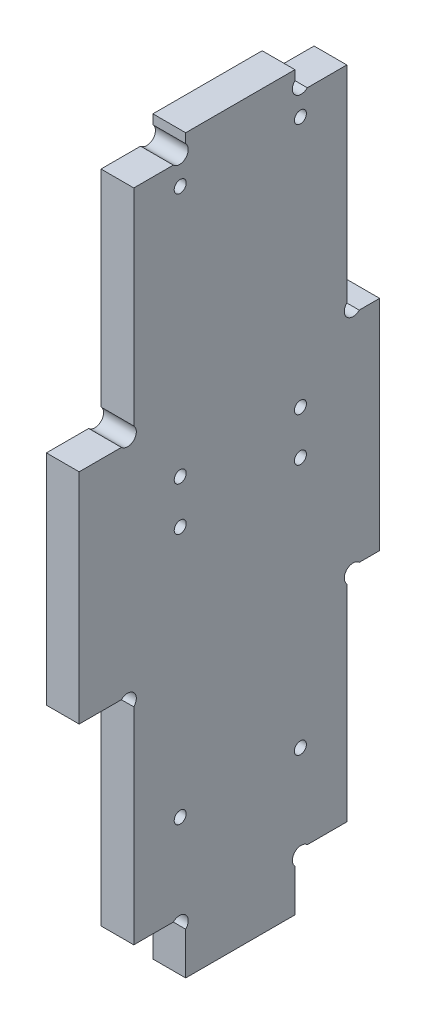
from build123d import *

# Parameters (mm, degrees)
ESQUISSE1_R      = 1.1
EXTRUSION1_DEPTH = 6


with BuildPart() as part:
    # Esquisse1 → Extrusion1 (new body)
    with BuildSketch(Plane(origin=(0, 0, 0), x_dir=(0, 0, -1), z_dir=(1, 0, 0))):
        with BuildLine():
            Line((19.5, 7.7372583), (19.5, 0))
            Line((19.5, 0), (39.5, 0))
            Line((39.5, 0), (39.5, 7.7372583))
            ThreePointArc((39.5, 7.7372583), (39.5, 10), (41.7627417, 10))
            Line((41.7627417, 10), (49, 10))
            Line((49, 10), (49, 47.7372583))
            ThreePointArc((49, 47.7372583), (49, 50), (51.2627417, 50))
            Line((51.2627417, 50), (55, 50))
            Line((55, 50), (55, 90))
            Line((55, 90), (51.2627417, 90))
            ThreePointArc((51.2627417, 90), (49, 90), (49, 92.2627417))
            Line((49, 92.2627417), (49, 130))
            Line((49, 130), (41.7627417, 130))
            ThreePointArc((41.7627417, 130), (39.5, 130), (39.5, 132.2627417))
            Line((39.5, 132.2627417), (39.5, 134))
            Line((39.5, 134), (19.5, 134))
            Line((19.5, 134), (19.5, 132.2627417))
            ThreePointArc((19.5, 132.2627417), (19.5, 130), (17.2372583, 130))
            Line((17.2372583, 130), (10, 130))
            Line((10, 130), (10, 92.2627417))
            ThreePointArc((10, 92.2627417), (10, 90), (7.7372583, 90))
            Line((7.7372583, 90), (0, 90))
            Line((0, 90), (0, 50))
            Line((0, 50), (7.7372583, 50))
            ThreePointArc((7.7372583, 50), (10, 50), (10, 47.7372583))
            Line((10, 47.7372583), (10, 10))
            Line((10, 10), (17.2372583, 10))
            ThreePointArc((17.2372583, 10), (19.5, 10), (19.5, 7.7372583))
        make_face()
        with Locations((18.5, 126)):
            Circle(ESQUISSE1_R, mode=Mode.SUBTRACT)
        with Locations((18.5, 80)):
            Circle(ESQUISSE1_R, mode=Mode.SUBTRACT)
        with Locations(Location((40.5, 126, 0), (0, 0, 180))):
            Circle(ESQUISSE1_R, mode=Mode.SUBTRACT)
        with Locations(Location((40.5, 80, 0), (0, 0, 180))):
            Circle(ESQUISSE1_R, mode=Mode.SUBTRACT)
        with Locations(Location((18.5, 72, 0), (0, 0, 180))):
            Circle(ESQUISSE1_R, mode=Mode.SUBTRACT)
        with Locations((40.5, 72)):
            Circle(ESQUISSE1_R, mode=Mode.SUBTRACT)
        with Locations((40.5, 26)):
            Circle(ESQUISSE1_R, mode=Mode.SUBTRACT)
        with Locations(Location((18.5, 26, 0), (0, 0, 180))):
            Circle(ESQUISSE1_R, mode=Mode.SUBTRACT)
    extrude(amount=EXTRUSION1_DEPTH)


solid = part.part
